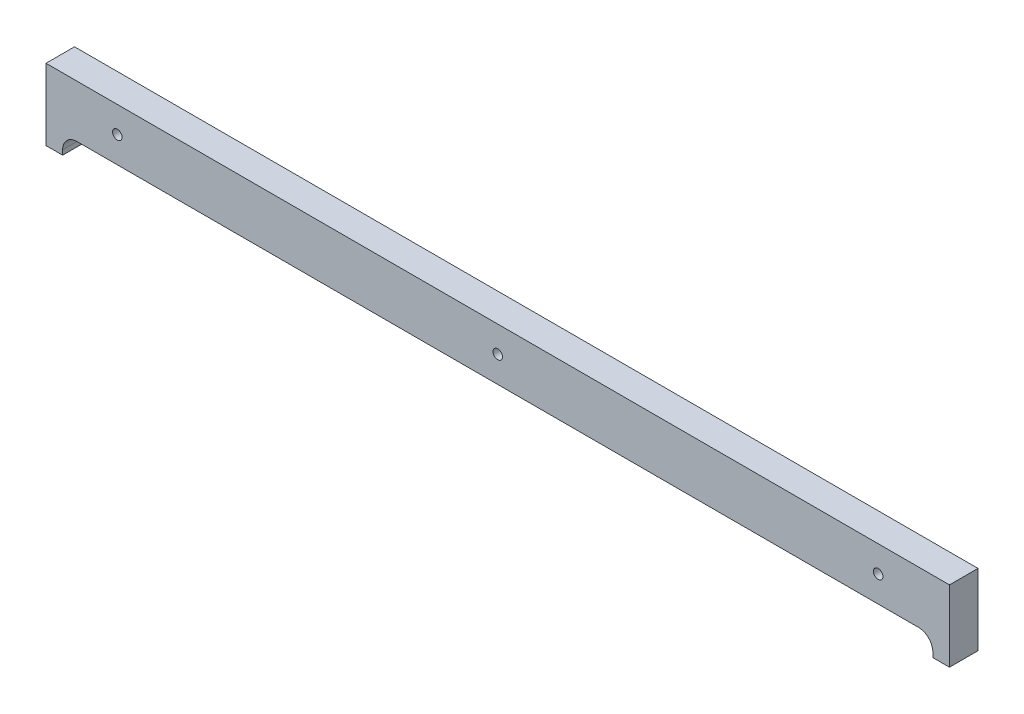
from build123d import *

# Parameters (mm, degrees)
ESQUISSE1_W             = 190
ESQUISSE1_H             = 15
EXTRUSION1_DEPTH        = 6
ENL_V_MAT_EXTRU_1_DEPTH = 4
ESQUISSE3_R             = 1
ENL_V_MAT_EXTRU_2_DEPTH = 191.68560512


with BuildPart() as part:
    # Esquisse1 → Extrusion1 (new body)
    with BuildSketch(Plane.XY):
        with Locations((95, 7.5)):
            Rectangle(ESQUISSE1_W, ESQUISSE1_H)
    extrude(amount=EXTRUSION1_DEPTH)

    # Esquisse2 → Enl_v. mat.-Extru.1 (cut)
    with BuildSketch(Plane.XY.offset(6)):
        with BuildLine():
            Line((3.5, 0), (186.5, 0))
            Line((186.5, 0), (186.5, 1))
            ThreePointArc((186.5, 1), (185.621320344, 3.121320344), (183.5, 4))
            Line((183.5, 4), (6.5, 4))
            ThreePointArc((6.5, 4), (4.378679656, 3.121320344), (3.5, 1))
            Line((3.5, 1), (3.5, 0))
        make_face()
    extrude(amount=-ENL_V_MAT_EXTRU_1_DEPTH, mode=Mode.SUBTRACT)

    # Esquisse3 → Enl_v. mat.-Extru.2 (cut, through all)
    with BuildSketch(Plane.XY.offset(6)):
        with Locations((95, 9.5)):
            Circle(ESQUISSE3_R)
        with Locations((175, 9.5)):
            Circle(ESQUISSE3_R)
        with Locations((15, 9.5)):
            Circle(ESQUISSE3_R)
    extrude(amount=-ENL_V_MAT_EXTRU_2_DEPTH, mode=Mode.SUBTRACT)


solid = part.part
